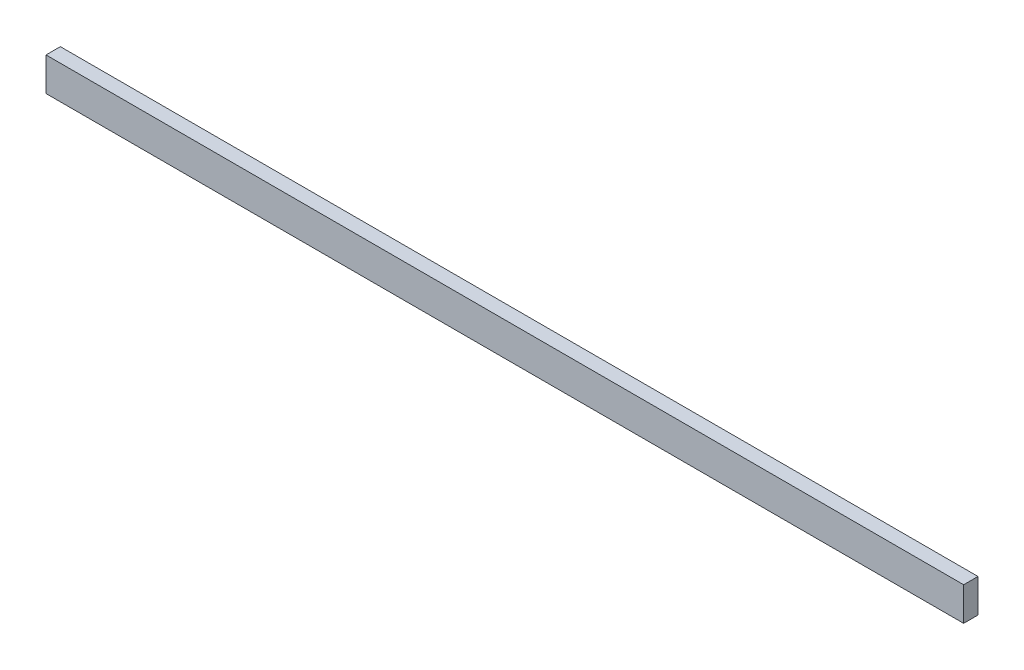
from build123d import *

# Parameters (mm, degrees)
SKETCH1_W      = 38.1
SKETCH1_H      = 88.9
EXTRUDE1_DEPTH = 2438.4


with BuildPart() as part:
    # Sketch1 → Extrude1 (new body)
    with BuildSketch(Plane(origin=(0, 0, 0), x_dir=(0, 0, -1), z_dir=(1, 0, 0))):
        with Locations((19.05, 44.45)):
            Rectangle(SKETCH1_W, SKETCH1_H)
    extrude(amount=EXTRUDE1_DEPTH)


solid = part.part
